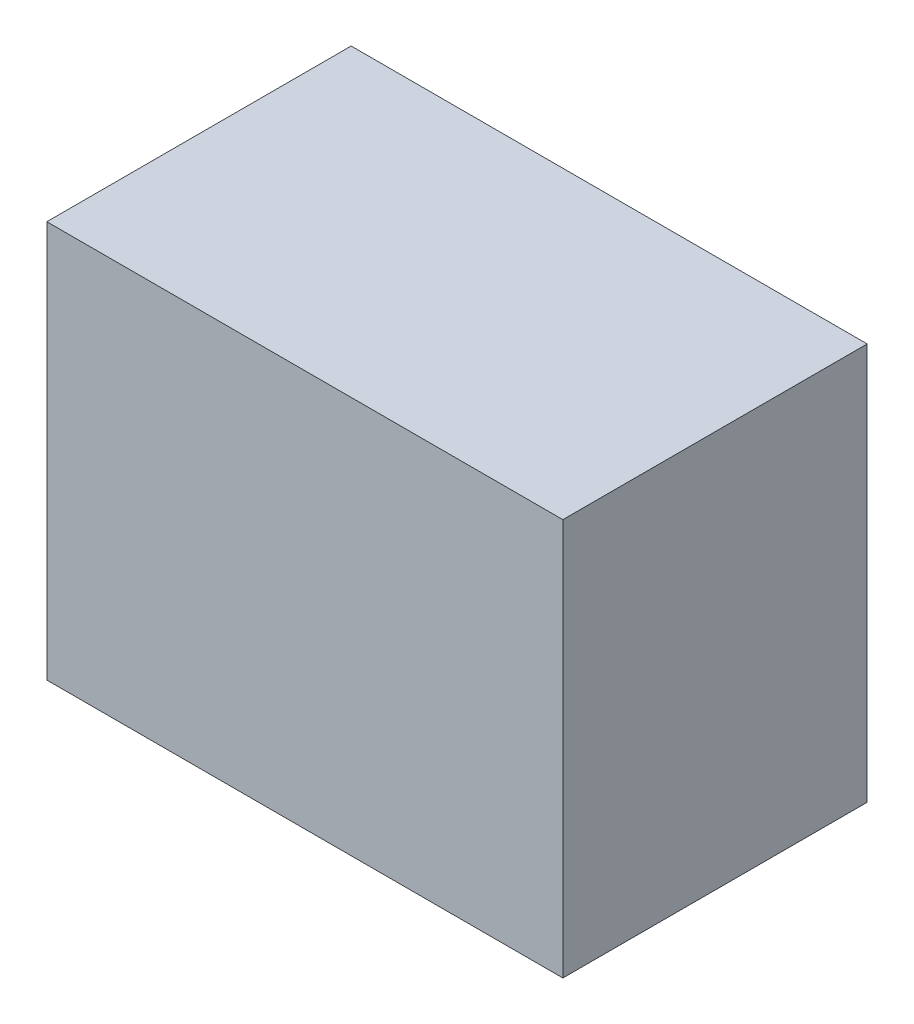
ISO-10303-21;
HEADER;
FILE_DESCRIPTION(('STEP AP214'),'2;1');
FILE_NAME('part.step','',(''),(''),'','','');
FILE_SCHEMA(('AUTOMOTIVE_DESIGN { 1 0 10303 214 1 1 1 1 }'));
ENDSEC;
DATA;
#1=APPLICATION_CONTEXT('core data for automotive mechanical design processes');
#2=APPLICATION_PROTOCOL_DEFINITION('international standard','automotive_design',2000,#1);
#3=PRODUCT_CONTEXT('',#1,'mechanical');
#4=PRODUCT('Part','Part','',(#3));
#5=PRODUCT_RELATED_PRODUCT_CATEGORY('part','',(#4));
#6=PRODUCT_DEFINITION_FORMATION('','',#4);
#7=PRODUCT_DEFINITION_CONTEXT('part definition',#1,'design');
#8=PRODUCT_DEFINITION('design','',#6,#7);
#9=PRODUCT_DEFINITION_SHAPE('','',#8);
#10=(LENGTH_UNIT() NAMED_UNIT(*) SI_UNIT(.MILLI.,.METRE.));
#11=(NAMED_UNIT(*) PLANE_ANGLE_UNIT() SI_UNIT($,.RADIAN.));
#12=(NAMED_UNIT(*) SI_UNIT($,.STERADIAN.) SOLID_ANGLE_UNIT());
#13=UNCERTAINTY_MEASURE_WITH_UNIT(LENGTH_MEASURE(1.E-05),#10,'distance_accuracy_value','');
#14=(GEOMETRIC_REPRESENTATION_CONTEXT(3) GLOBAL_UNCERTAINTY_ASSIGNED_CONTEXT((#13)) GLOBAL_UNIT_ASSIGNED_CONTEXT((#10,
#11,#12)) REPRESENTATION_CONTEXT('',''));
#15=CARTESIAN_POINT('',(0.,0.,0.));
#16=DIRECTION('',(0.,0.,1.));
#17=DIRECTION('',(1.,0.,0.));
#18=AXIS2_PLACEMENT_3D('',#15,#16,#17);
#19=CARTESIAN_POINT('',(0.97499932,-0.7499985,1.15000024));
#20=DIRECTION('',(0.,0.,-1.));
#21=DIRECTION('',(-1.,0.,0.));
#22=AXIS2_PLACEMENT_3D('',#19,#20,#21);
#23=PLANE('',#22);
#24=DIRECTION('',(1.,0.,0.));
#25=VECTOR('',#24,1.);
#26=CARTESIAN_POINT('',(0.97499932,0.75000104,1.15000024));
#27=LINE('',#26,#25);
#28=CARTESIAN_POINT('',(0.97499932,0.75000104,1.15000024));
#29=VERTEX_POINT('',#28);
#30=CARTESIAN_POINT('',(-0.97499932,0.75000104,1.15000024));
#31=VERTEX_POINT('',#30);
#32=EDGE_CURVE('E54',#29,#31,#27,.F.);
#33=ORIENTED_EDGE('',*,*,#32,.T.);
#34=DIRECTION('',(0.,1.,0.));
#35=VECTOR('',#34,1.);
#36=CARTESIAN_POINT('',(-0.97499932,0.75000104,1.15000024));
#37=LINE('',#36,#35);
#38=CARTESIAN_POINT('',(-0.97499932,-0.7499985,1.15000024));
#39=VERTEX_POINT('',#38);
#40=EDGE_CURVE('E57',#31,#39,#37,.F.);
#41=ORIENTED_EDGE('',*,*,#40,.T.);
#42=DIRECTION('',(1.,0.,0.));
#43=VECTOR('',#42,1.);
#44=CARTESIAN_POINT('',(-0.97499932,-0.7499985,1.15000024));
#45=LINE('',#44,#43);
#46=CARTESIAN_POINT('',(0.97499932,-0.7499985,1.15000024));
#47=VERTEX_POINT('',#46);
#48=EDGE_CURVE('E59',#39,#47,#45,.T.);
#49=ORIENTED_EDGE('',*,*,#48,.T.);
#50=DIRECTION('',(0.,1.,0.));
#51=VECTOR('',#50,1.);
#52=CARTESIAN_POINT('',(0.97499932,-0.7499985,1.15000024));
#53=LINE('',#52,#51);
#54=EDGE_CURVE('E19',#29,#47,#53,.F.);
#55=ORIENTED_EDGE('',*,*,#54,.F.);
#56=EDGE_LOOP('',(#33,#41,#49,#55));
#57=FACE_BOUND('',#56,.T.);
#58=ADVANCED_FACE('F16',(#57),#23,.F.);
#59=CARTESIAN_POINT('',(-0.97499932,-0.7499985,0.));
#60=DIRECTION('',(0.,1.,0.));
#61=DIRECTION('',(0.,0.,1.));
#62=AXIS2_PLACEMENT_3D('',#59,#60,#61);
#63=PLANE('',#62);
#64=DIRECTION('',(0.,0.,1.));
#65=VECTOR('',#64,1.);
#66=CARTESIAN_POINT('',(0.97499932,-0.7499985,0.));
#67=LINE('',#66,#65);
#68=CARTESIAN_POINT('',(0.97499932,-0.7499985,0.));
#69=VERTEX_POINT('',#68);
#70=EDGE_CURVE('E70',#69,#47,#67,.T.);
#71=ORIENTED_EDGE('',*,*,#70,.T.);
#72=ORIENTED_EDGE('',*,*,#48,.F.);
#73=DIRECTION('',(0.,0.,-1.));
#74=VECTOR('',#73,1.);
#75=CARTESIAN_POINT('',(-0.97499932,-0.7499985,0.));
#76=LINE('',#75,#74);
#77=CARTESIAN_POINT('',(-0.97499932,-0.7499985,0.));
#78=VERTEX_POINT('',#77);
#79=EDGE_CURVE('E64',#39,#78,#76,.T.);
#80=ORIENTED_EDGE('',*,*,#79,.T.);
#81=DIRECTION('',(-1.,0.,0.));
#82=VECTOR('',#81,1.);
#83=CARTESIAN_POINT('',(0.97499932,-0.7499985,0.));
#84=LINE('',#83,#82);
#85=EDGE_CURVE('E82',#69,#78,#84,.T.);
#86=ORIENTED_EDGE('',*,*,#85,.F.);
#87=EDGE_LOOP('',(#71,#72,#80,#86));
#88=FACE_BOUND('',#87,.T.);
#89=ADVANCED_FACE('F67',(#88),#63,.F.);
#90=CARTESIAN_POINT('',(-0.97499932,0.75000104,0.));
#91=DIRECTION('',(1.,0.,0.));
#92=DIRECTION('',(0.,0.,-1.));
#93=AXIS2_PLACEMENT_3D('',#90,#91,#92);
#94=PLANE('',#93);
#95=ORIENTED_EDGE('',*,*,#79,.F.);
#96=ORIENTED_EDGE('',*,*,#40,.F.);
#97=DIRECTION('',(0.,0.,-1.));
#98=VECTOR('',#97,1.);
#99=CARTESIAN_POINT('',(-0.97499932,0.75000104,0.));
#100=LINE('',#99,#98);
#101=CARTESIAN_POINT('',(-0.97499932,0.75000104,0.));
#102=VERTEX_POINT('',#101);
#103=EDGE_CURVE('E76',#31,#102,#100,.T.);
#104=ORIENTED_EDGE('',*,*,#103,.T.);
#105=DIRECTION('',(0.,1.,0.));
#106=VECTOR('',#105,1.);
#107=CARTESIAN_POINT('',(-0.97499932,-0.7499985,0.));
#108=LINE('',#107,#106);
#109=EDGE_CURVE('E73',#78,#102,#108,.T.);
#110=ORIENTED_EDGE('',*,*,#109,.F.);
#111=EDGE_LOOP('',(#95,#96,#104,#110));
#112=FACE_BOUND('',#111,.T.);
#113=ADVANCED_FACE('F71',(#112),#94,.F.);
#114=CARTESIAN_POINT('',(0.97499932,0.75000104,0.));
#115=DIRECTION('',(0.,-1.,0.));
#116=DIRECTION('',(0.,0.,-1.));
#117=AXIS2_PLACEMENT_3D('',#114,#115,#116);
#118=PLANE('',#117);
#119=ORIENTED_EDGE('',*,*,#103,.F.);
#120=ORIENTED_EDGE('',*,*,#32,.F.);
#121=DIRECTION('',(0.,0.,1.));
#122=VECTOR('',#121,1.);
#123=CARTESIAN_POINT('',(0.97499932,0.75000104,0.));
#124=LINE('',#123,#122);
#125=CARTESIAN_POINT('',(0.97499932,0.75000104,0.));
#126=VERTEX_POINT('',#125);
#127=EDGE_CURVE('E34',#29,#126,#124,.F.);
#128=ORIENTED_EDGE('',*,*,#127,.T.);
#129=DIRECTION('',(-1.,0.,0.));
#130=VECTOR('',#129,1.);
#131=CARTESIAN_POINT('',(0.97499932,0.75000104,0.));
#132=LINE('',#131,#130);
#133=EDGE_CURVE('E25',#102,#126,#132,.F.);
#134=ORIENTED_EDGE('',*,*,#133,.F.);
#135=EDGE_LOOP('',(#119,#120,#128,#134));
#136=FACE_BOUND('',#135,.T.);
#137=ADVANCED_FACE('F88',(#136),#118,.F.);
#138=CARTESIAN_POINT('',(0.97499932,-0.7499985,0.));
#139=DIRECTION('',(-1.,0.,0.));
#140=DIRECTION('',(0.,0.,1.));
#141=AXIS2_PLACEMENT_3D('',#138,#139,#140);
#142=PLANE('',#141);
#143=ORIENTED_EDGE('',*,*,#127,.F.);
#144=ORIENTED_EDGE('',*,*,#54,.T.);
#145=ORIENTED_EDGE('',*,*,#70,.F.);
#146=DIRECTION('',(0.,1.,0.));
#147=VECTOR('',#146,1.);
#148=CARTESIAN_POINT('',(0.97499932,-0.7499985,0.));
#149=LINE('',#148,#147);
#150=EDGE_CURVE('E11',#126,#69,#149,.F.);
#151=ORIENTED_EDGE('',*,*,#150,.F.);
#152=EDGE_LOOP('',(#143,#144,#145,#151));
#153=FACE_BOUND('',#152,.T.);
#154=ADVANCED_FACE('F90',(#153),#142,.F.);
#155=CARTESIAN_POINT('',(0.97499932,-0.7499985,0.));
#156=DIRECTION('',(0.,0.,-1.));
#157=DIRECTION('',(-1.,0.,0.));
#158=AXIS2_PLACEMENT_3D('',#155,#156,#157);
#159=PLANE('',#158);
#160=ORIENTED_EDGE('',*,*,#133,.T.);
#161=ORIENTED_EDGE('',*,*,#150,.T.);
#162=ORIENTED_EDGE('',*,*,#85,.T.);
#163=ORIENTED_EDGE('',*,*,#109,.T.);
#164=EDGE_LOOP('',(#160,#161,#162,#163));
#165=FACE_BOUND('',#164,.T.);
#166=ADVANCED_FACE('F87',(#165),#159,.T.);
#167=CLOSED_SHELL('',(#58,#89,#113,#137,#154,#166));
#168=MANIFOLD_SOLID_BREP('B1',#167);
#169=ADVANCED_BREP_SHAPE_REPRESENTATION('',(#18,#168),#14);
#170=SHAPE_DEFINITION_REPRESENTATION(#9,#169);
ENDSEC;
END-ISO-10303-21;
